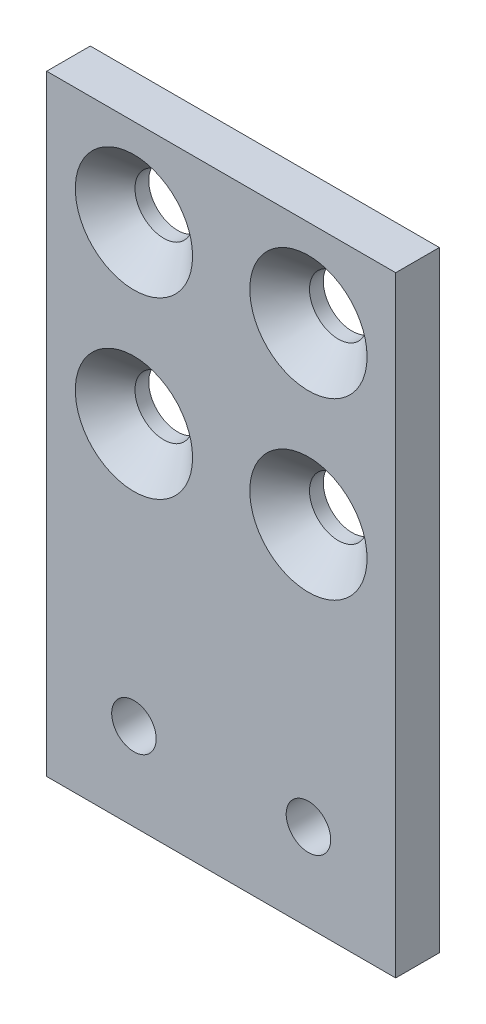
ISO-10303-21;
HEADER;
FILE_DESCRIPTION(('STEP AP214'),'2;1');
FILE_NAME('part.step','',(''),(''),'','','');
FILE_SCHEMA(('AUTOMOTIVE_DESIGN { 1 0 10303 214 1 1 1 1 }'));
ENDSEC;
DATA;
#1=APPLICATION_CONTEXT('core data for automotive mechanical design processes');
#2=APPLICATION_PROTOCOL_DEFINITION('international standard','automotive_design',2000,#1);
#3=PRODUCT_CONTEXT('',#1,'mechanical');
#4=PRODUCT('Part','Part','',(#3));
#5=PRODUCT_RELATED_PRODUCT_CATEGORY('part','',(#4));
#6=PRODUCT_DEFINITION_FORMATION('','',#4);
#7=PRODUCT_DEFINITION_CONTEXT('part definition',#1,'design');
#8=PRODUCT_DEFINITION('design','',#6,#7);
#9=PRODUCT_DEFINITION_SHAPE('','',#8);
#10=(LENGTH_UNIT() NAMED_UNIT(*) SI_UNIT(.MILLI.,.METRE.));
#11=(NAMED_UNIT(*) PLANE_ANGLE_UNIT() SI_UNIT($,.RADIAN.));
#12=(NAMED_UNIT(*) SI_UNIT($,.STERADIAN.) SOLID_ANGLE_UNIT());
#13=UNCERTAINTY_MEASURE_WITH_UNIT(LENGTH_MEASURE(1.E-05),#10,'distance_accuracy_value','');
#14=(GEOMETRIC_REPRESENTATION_CONTEXT(3) GLOBAL_UNCERTAINTY_ASSIGNED_CONTEXT((#13)) GLOBAL_UNIT_ASSIGNED_CONTEXT((#10,
#11,#12)) REPRESENTATION_CONTEXT('',''));
#15=CARTESIAN_POINT('',(0.,0.,0.));
#16=DIRECTION('',(0.,0.,1.));
#17=DIRECTION('',(1.,0.,0.));
#18=AXIS2_PLACEMENT_3D('',#15,#16,#17);
#19=CARTESIAN_POINT('',(-89.4885450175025,19.05,5.));
#20=DIRECTION('',(1.,0.,0.));
#21=DIRECTION('',(0.,1.,0.));
#22=AXIS2_PLACEMENT_3D('',#19,#20,#21);
#23=PLANE('',#22);
#24=DIRECTION('',(0.,-1.,0.));
#25=VECTOR('',#24,1.);
#26=CARTESIAN_POINT('',(-89.4885450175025,19.05,0.));
#27=LINE('',#26,#25);
#28=CARTESIAN_POINT('',(-89.4885450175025,19.05,0.));
#29=VERTEX_POINT('',#28);
#30=CARTESIAN_POINT('',(-89.4885450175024,-50.95,0.));
#31=VERTEX_POINT('',#30);
#32=EDGE_CURVE('E98',#29,#31,#27,.T.);
#33=ORIENTED_EDGE('',*,*,#32,.T.);
#34=DIRECTION('',(0.,0.,-1.));
#35=VECTOR('',#34,1.);
#36=CARTESIAN_POINT('',(-89.4885450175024,-50.95,5.));
#37=LINE('',#36,#35);
#38=CARTESIAN_POINT('',(-89.4885450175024,-50.95,5.));
#39=VERTEX_POINT('',#38);
#40=EDGE_CURVE('E11',#39,#31,#37,.T.);
#41=ORIENTED_EDGE('',*,*,#40,.F.);
#42=DIRECTION('',(0.,-1.,0.));
#43=VECTOR('',#42,1.);
#44=CARTESIAN_POINT('',(-89.4885450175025,19.05,5.));
#45=LINE('',#44,#43);
#46=CARTESIAN_POINT('',(-89.4885450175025,19.05,5.));
#47=VERTEX_POINT('',#46);
#48=EDGE_CURVE('E85',#47,#39,#45,.T.);
#49=ORIENTED_EDGE('',*,*,#48,.F.);
#50=DIRECTION('',(0.,0.,-1.));
#51=VECTOR('',#50,1.);
#52=CARTESIAN_POINT('',(-89.4885450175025,19.05,5.));
#53=LINE('',#52,#51);
#54=EDGE_CURVE('E94',#47,#29,#53,.T.);
#55=ORIENTED_EDGE('',*,*,#54,.T.);
#56=EDGE_LOOP('',(#33,#41,#49,#55));
#57=FACE_BOUND('',#56,.T.);
#58=ADVANCED_FACE('F32',(#57),#23,.F.);
#59=CARTESIAN_POINT('',(-89.4885450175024,-50.95,5.));
#60=DIRECTION('',(0.,1.,0.));
#61=DIRECTION('',(0.,0.,1.));
#62=AXIS2_PLACEMENT_3D('',#59,#60,#61);
#63=PLANE('',#62);
#64=DIRECTION('',(1.,0.,0.));
#65=VECTOR('',#64,1.);
#66=CARTESIAN_POINT('',(-89.4885450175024,-50.95,0.));
#67=LINE('',#66,#65);
#68=CARTESIAN_POINT('',(-49.4885450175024,-50.95,0.));
#69=VERTEX_POINT('',#68);
#70=EDGE_CURVE('E89',#31,#69,#67,.T.);
#71=ORIENTED_EDGE('',*,*,#70,.T.);
#72=DIRECTION('',(0.,0.,-1.));
#73=VECTOR('',#72,1.);
#74=CARTESIAN_POINT('',(-49.4885450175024,-50.95,5.));
#75=LINE('',#74,#73);
#76=CARTESIAN_POINT('',(-49.4885450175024,-50.95,5.));
#77=VERTEX_POINT('',#76);
#78=EDGE_CURVE('E41',#77,#69,#75,.T.);
#79=ORIENTED_EDGE('',*,*,#78,.F.);
#80=DIRECTION('',(1.,0.,0.));
#81=VECTOR('',#80,1.);
#82=CARTESIAN_POINT('',(-89.4885450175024,-50.95,5.));
#83=LINE('',#82,#81);
#84=EDGE_CURVE('E80',#39,#77,#83,.T.);
#85=ORIENTED_EDGE('',*,*,#84,.F.);
#86=ORIENTED_EDGE('',*,*,#40,.T.);
#87=EDGE_LOOP('',(#71,#79,#85,#86));
#88=FACE_BOUND('',#87,.T.);
#89=ADVANCED_FACE('F88',(#88),#63,.F.);
#90=CARTESIAN_POINT('',(-49.4885450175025,19.05,5.));
#91=DIRECTION('',(-1.,0.,0.));
#92=DIRECTION('',(0.,-1.,0.));
#93=AXIS2_PLACEMENT_3D('',#90,#91,#92);
#94=PLANE('',#93);
#95=DIRECTION('',(0.,1.,0.));
#96=VECTOR('',#95,1.);
#97=CARTESIAN_POINT('',(-49.4885450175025,19.05,0.));
#98=LINE('',#97,#96);
#99=CARTESIAN_POINT('',(-49.4885450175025,19.05,0.));
#100=VERTEX_POINT('',#99);
#101=EDGE_CURVE('E67',#69,#100,#98,.T.);
#102=ORIENTED_EDGE('',*,*,#101,.T.);
#103=DIRECTION('',(0.,0.,-1.));
#104=VECTOR('',#103,1.);
#105=CARTESIAN_POINT('',(-49.4885450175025,19.05,5.));
#106=LINE('',#105,#104);
#107=CARTESIAN_POINT('',(-49.4885450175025,19.05,5.));
#108=VERTEX_POINT('',#107);
#109=EDGE_CURVE('E90',#108,#100,#106,.T.);
#110=ORIENTED_EDGE('',*,*,#109,.F.);
#111=DIRECTION('',(0.,1.,0.));
#112=VECTOR('',#111,1.);
#113=CARTESIAN_POINT('',(-49.4885450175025,19.05,5.));
#114=LINE('',#113,#112);
#115=EDGE_CURVE('E83',#77,#108,#114,.T.);
#116=ORIENTED_EDGE('',*,*,#115,.F.);
#117=ORIENTED_EDGE('',*,*,#78,.T.);
#118=EDGE_LOOP('',(#102,#110,#116,#117));
#119=FACE_BOUND('',#118,.T.);
#120=ADVANCED_FACE('F92',(#119),#94,.F.);
#121=CARTESIAN_POINT('',(-89.4885450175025,19.05,5.));
#122=DIRECTION('',(0.,-1.,0.));
#123=DIRECTION('',(0.,0.,-1.));
#124=AXIS2_PLACEMENT_3D('',#121,#122,#123);
#125=PLANE('',#124);
#126=DIRECTION('',(-1.,0.,0.));
#127=VECTOR('',#126,1.);
#128=CARTESIAN_POINT('',(-89.4885450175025,19.05,0.));
#129=LINE('',#128,#127);
#130=EDGE_CURVE('E73',#100,#29,#129,.T.);
#131=ORIENTED_EDGE('',*,*,#130,.T.);
#132=ORIENTED_EDGE('',*,*,#54,.F.);
#133=DIRECTION('',(-1.,0.,0.));
#134=VECTOR('',#133,1.);
#135=CARTESIAN_POINT('',(-89.4885450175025,19.05,5.));
#136=LINE('',#135,#134);
#137=EDGE_CURVE('E50',#108,#47,#136,.T.);
#138=ORIENTED_EDGE('',*,*,#137,.F.);
#139=ORIENTED_EDGE('',*,*,#109,.T.);
#140=EDGE_LOOP('',(#131,#132,#138,#139));
#141=FACE_BOUND('',#140,.T.);
#142=ADVANCED_FACE('F172',(#141),#125,.F.);
#143=CARTESIAN_POINT('',(-89.4885450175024,-50.95,5.));
#144=DIRECTION('',(0.,0.,1.));
#145=DIRECTION('',(1.,0.,0.));
#146=AXIS2_PLACEMENT_3D('',#143,#144,#145);
#147=PLANE('',#146);
#148=CARTESIAN_POINT('',(-79.4885450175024,-40.95,5.));
#149=DIRECTION('',(0.,0.,1.));
#150=DIRECTION('',(1.,0.,0.));
#151=AXIS2_PLACEMENT_3D('',#148,#149,#150);
#152=CIRCLE('',#151,2.55);
#153=CARTESIAN_POINT('',(-76.9385450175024,-40.95,5.));
#154=VERTEX_POINT('',#153);
#155=EDGE_CURVE('E120',#154,#154,#152,.T.);
#156=ORIENTED_EDGE('',*,*,#155,.F.);
#157=EDGE_LOOP('',(#156));
#158=FACE_BOUND('',#157,.T.);
#159=CARTESIAN_POINT('',(-59.4885450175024,-40.95,5.));
#160=DIRECTION('',(0.,0.,1.));
#161=DIRECTION('',(1.,0.,0.));
#162=AXIS2_PLACEMENT_3D('',#159,#160,#161);
#163=CIRCLE('',#162,2.55);
#164=CARTESIAN_POINT('',(-56.9385450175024,-40.95,5.));
#165=VERTEX_POINT('',#164);
#166=EDGE_CURVE('E109',#165,#165,#163,.T.);
#167=ORIENTED_EDGE('',*,*,#166,.F.);
#168=EDGE_LOOP('',(#167));
#169=FACE_BOUND('',#168,.T.);
#170=CARTESIAN_POINT('',(-59.4885450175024,9.05,5.));
#171=DIRECTION('',(0.,0.,1.));
#172=DIRECTION('',(1.,0.,0.));
#173=AXIS2_PLACEMENT_3D('',#170,#171,#172);
#174=CIRCLE('',#173,6.72);
#175=CARTESIAN_POINT('',(-52.7685450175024,9.05,5.));
#176=VERTEX_POINT('',#175);
#177=EDGE_CURVE('E108',#176,#176,#174,.T.);
#178=ORIENTED_EDGE('',*,*,#177,.F.);
#179=EDGE_LOOP('',(#178));
#180=FACE_BOUND('',#179,.T.);
#181=CARTESIAN_POINT('',(-79.4885450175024,9.05,5.));
#182=DIRECTION('',(0.,0.,1.));
#183=DIRECTION('',(1.,0.,0.));
#184=AXIS2_PLACEMENT_3D('',#181,#182,#183);
#185=CIRCLE('',#184,6.72);
#186=CARTESIAN_POINT('',(-72.7685450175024,9.05,5.));
#187=VERTEX_POINT('',#186);
#188=EDGE_CURVE('E128',#187,#187,#185,.T.);
#189=ORIENTED_EDGE('',*,*,#188,.F.);
#190=EDGE_LOOP('',(#189));
#191=FACE_BOUND('',#190,.T.);
#192=CARTESIAN_POINT('',(-59.4885450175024,-10.95,5.));
#193=DIRECTION('',(0.,0.,1.));
#194=DIRECTION('',(1.,0.,0.));
#195=AXIS2_PLACEMENT_3D('',#192,#193,#194);
#196=CIRCLE('',#195,6.72);
#197=CARTESIAN_POINT('',(-52.7685450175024,-10.95,5.));
#198=VERTEX_POINT('',#197);
#199=EDGE_CURVE('E137',#198,#198,#196,.T.);
#200=ORIENTED_EDGE('',*,*,#199,.F.);
#201=EDGE_LOOP('',(#200));
#202=FACE_BOUND('',#201,.T.);
#203=CARTESIAN_POINT('',(-79.4885450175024,-10.95,5.));
#204=DIRECTION('',(0.,0.,1.));
#205=DIRECTION('',(1.,0.,0.));
#206=AXIS2_PLACEMENT_3D('',#203,#204,#205);
#207=CIRCLE('',#206,6.72);
#208=CARTESIAN_POINT('',(-72.7685450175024,-10.95,5.));
#209=VERTEX_POINT('',#208);
#210=EDGE_CURVE('E146',#209,#209,#207,.T.);
#211=ORIENTED_EDGE('',*,*,#210,.F.);
#212=EDGE_LOOP('',(#211));
#213=FACE_BOUND('',#212,.T.);
#214=ORIENTED_EDGE('',*,*,#48,.T.);
#215=ORIENTED_EDGE('',*,*,#84,.T.);
#216=ORIENTED_EDGE('',*,*,#115,.T.);
#217=ORIENTED_EDGE('',*,*,#137,.T.);
#218=EDGE_LOOP('',(#214,#215,#216,#217));
#219=FACE_BOUND('',#218,.T.);
#220=ADVANCED_FACE('F81',(#158,#169,#180,#191,#202,#213,#219),#147,.T.);
#221=CARTESIAN_POINT('',(-89.4885450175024,-50.95,0.));
#222=DIRECTION('',(0.,0.,1.));
#223=DIRECTION('',(1.,0.,0.));
#224=AXIS2_PLACEMENT_3D('',#221,#222,#223);
#225=PLANE('',#224);
#226=CARTESIAN_POINT('',(-79.4885450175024,-40.95,0.));
#227=DIRECTION('',(0.,0.,1.));
#228=DIRECTION('',(1.,0.,0.));
#229=AXIS2_PLACEMENT_3D('',#226,#227,#228);
#230=CIRCLE('',#229,2.55);
#231=CARTESIAN_POINT('',(-76.9385450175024,-40.95,0.));
#232=VERTEX_POINT('',#231);
#233=EDGE_CURVE('E35',#232,#232,#230,.T.);
#234=ORIENTED_EDGE('',*,*,#233,.T.);
#235=EDGE_LOOP('',(#234));
#236=FACE_BOUND('',#235,.T.);
#237=CARTESIAN_POINT('',(-59.4885450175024,-40.95,0.));
#238=DIRECTION('',(0.,0.,1.));
#239=DIRECTION('',(1.,0.,0.));
#240=AXIS2_PLACEMENT_3D('',#237,#238,#239);
#241=CIRCLE('',#240,2.55);
#242=CARTESIAN_POINT('',(-56.9385450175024,-40.95,0.));
#243=VERTEX_POINT('',#242);
#244=EDGE_CURVE('E106',#243,#243,#241,.T.);
#245=ORIENTED_EDGE('',*,*,#244,.T.);
#246=EDGE_LOOP('',(#245));
#247=FACE_BOUND('',#246,.T.);
#248=CARTESIAN_POINT('',(-59.4885450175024,9.05,0.));
#249=DIRECTION('',(0.,0.,1.));
#250=DIRECTION('',(1.,0.,0.));
#251=AXIS2_PLACEMENT_3D('',#248,#249,#250);
#252=CIRCLE('',#251,3.3);
#253=CARTESIAN_POINT('',(-56.1885450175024,9.05,0.));
#254=VERTEX_POINT('',#253);
#255=EDGE_CURVE('E125',#254,#254,#252,.T.);
#256=ORIENTED_EDGE('',*,*,#255,.T.);
#257=EDGE_LOOP('',(#256));
#258=FACE_BOUND('',#257,.T.);
#259=CARTESIAN_POINT('',(-79.4885450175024,9.05,0.));
#260=DIRECTION('',(0.,0.,1.));
#261=DIRECTION('',(1.,0.,0.));
#262=AXIS2_PLACEMENT_3D('',#259,#260,#261);
#263=CIRCLE('',#262,3.3);
#264=CARTESIAN_POINT('',(-76.1885450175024,9.05,0.));
#265=VERTEX_POINT('',#264);
#266=EDGE_CURVE('E134',#265,#265,#263,.T.);
#267=ORIENTED_EDGE('',*,*,#266,.T.);
#268=EDGE_LOOP('',(#267));
#269=FACE_BOUND('',#268,.T.);
#270=CARTESIAN_POINT('',(-59.4885450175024,-10.95,0.));
#271=DIRECTION('',(0.,0.,1.));
#272=DIRECTION('',(1.,0.,0.));
#273=AXIS2_PLACEMENT_3D('',#270,#271,#272);
#274=CIRCLE('',#273,3.3);
#275=CARTESIAN_POINT('',(-56.1885450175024,-10.95,0.));
#276=VERTEX_POINT('',#275);
#277=EDGE_CURVE('E143',#276,#276,#274,.T.);
#278=ORIENTED_EDGE('',*,*,#277,.T.);
#279=EDGE_LOOP('',(#278));
#280=FACE_BOUND('',#279,.T.);
#281=CARTESIAN_POINT('',(-79.4885450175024,-10.95,0.));
#282=DIRECTION('',(0.,0.,1.));
#283=DIRECTION('',(1.,0.,0.));
#284=AXIS2_PLACEMENT_3D('',#281,#282,#283);
#285=CIRCLE('',#284,3.3);
#286=CARTESIAN_POINT('',(-76.1885450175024,-10.95,0.));
#287=VERTEX_POINT('',#286);
#288=EDGE_CURVE('E101',#287,#287,#285,.T.);
#289=ORIENTED_EDGE('',*,*,#288,.T.);
#290=EDGE_LOOP('',(#289));
#291=FACE_BOUND('',#290,.T.);
#292=ORIENTED_EDGE('',*,*,#32,.F.);
#293=ORIENTED_EDGE('',*,*,#130,.F.);
#294=ORIENTED_EDGE('',*,*,#101,.F.);
#295=ORIENTED_EDGE('',*,*,#70,.F.);
#296=EDGE_LOOP('',(#292,#293,#294,#295));
#297=FACE_BOUND('',#296,.T.);
#298=ADVANCED_FACE('F155',(#236,#247,#258,#269,#280,#291,#297),#225,.F.);
#299=CARTESIAN_POINT('',(-79.4885450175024,-10.95,5.));
#300=DIRECTION('',(0.,0.,1.));
#301=DIRECTION('',(1.,0.,0.));
#302=AXIS2_PLACEMENT_3D('',#299,#300,#301);
#303=CYLINDRICAL_SURFACE('',#302,3.3);
#304=ORIENTED_EDGE('',*,*,#288,.F.);
#305=EDGE_LOOP('',(#304));
#306=FACE_BOUND('',#305,.T.);
#307=CARTESIAN_POINT('',(-79.4885450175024,-10.95,1.58));
#308=DIRECTION('',(0.,0.,1.));
#309=DIRECTION('',(1.,0.,0.));
#310=AXIS2_PLACEMENT_3D('',#307,#308,#309);
#311=CIRCLE('',#310,3.3);
#312=CARTESIAN_POINT('',(-76.1885450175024,-10.95,1.58));
#313=VERTEX_POINT('',#312);
#314=EDGE_CURVE('E149',#313,#313,#311,.T.);
#315=ORIENTED_EDGE('',*,*,#314,.T.);
#316=EDGE_LOOP('',(#315));
#317=FACE_BOUND('',#316,.T.);
#318=ADVANCED_FACE('F158',(#306,#317),#303,.F.);
#319=CARTESIAN_POINT('',(-79.4885450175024,-10.95,5.));
#320=DIRECTION('',(0.,0.,1.));
#321=DIRECTION('',(1.,0.,0.));
#322=AXIS2_PLACEMENT_3D('',#319,#320,#321);
#323=CONICAL_SURFACE('',#322,6.72,0.785398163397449);
#324=ORIENTED_EDGE('',*,*,#314,.F.);
#325=EDGE_LOOP('',(#324));
#326=FACE_BOUND('',#325,.T.);
#327=ORIENTED_EDGE('',*,*,#210,.T.);
#328=EDGE_LOOP('',(#327));
#329=FACE_BOUND('',#328,.T.);
#330=ADVANCED_FACE('F161',(#326,#329),#323,.F.);
#331=CARTESIAN_POINT('',(-59.4885450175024,-10.95,5.));
#332=DIRECTION('',(0.,0.,1.));
#333=DIRECTION('',(1.,0.,0.));
#334=AXIS2_PLACEMENT_3D('',#331,#332,#333);
#335=CYLINDRICAL_SURFACE('',#334,3.3);
#336=ORIENTED_EDGE('',*,*,#277,.F.);
#337=EDGE_LOOP('',(#336));
#338=FACE_BOUND('',#337,.T.);
#339=CARTESIAN_POINT('',(-59.4885450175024,-10.95,1.58));
#340=DIRECTION('',(0.,0.,1.));
#341=DIRECTION('',(1.,0.,0.));
#342=AXIS2_PLACEMENT_3D('',#339,#340,#341);
#343=CIRCLE('',#342,3.3);
#344=CARTESIAN_POINT('',(-56.1885450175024,-10.95,1.58));
#345=VERTEX_POINT('',#344);
#346=EDGE_CURVE('E140',#345,#345,#343,.T.);
#347=ORIENTED_EDGE('',*,*,#346,.T.);
#348=EDGE_LOOP('',(#347));
#349=FACE_BOUND('',#348,.T.);
#350=ADVANCED_FACE('F167',(#338,#349),#335,.F.);
#351=CARTESIAN_POINT('',(-59.4885450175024,-10.95,5.));
#352=DIRECTION('',(0.,0.,1.));
#353=DIRECTION('',(1.,0.,0.));
#354=AXIS2_PLACEMENT_3D('',#351,#352,#353);
#355=CONICAL_SURFACE('',#354,6.72,0.785398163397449);
#356=ORIENTED_EDGE('',*,*,#346,.F.);
#357=EDGE_LOOP('',(#356));
#358=FACE_BOUND('',#357,.T.);
#359=ORIENTED_EDGE('',*,*,#199,.T.);
#360=EDGE_LOOP('',(#359));
#361=FACE_BOUND('',#360,.T.);
#362=ADVANCED_FACE('F223',(#358,#361),#355,.F.);
#363=CARTESIAN_POINT('',(-79.4885450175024,9.05,5.));
#364=DIRECTION('',(0.,0.,1.));
#365=DIRECTION('',(1.,0.,0.));
#366=AXIS2_PLACEMENT_3D('',#363,#364,#365);
#367=CYLINDRICAL_SURFACE('',#366,3.3);
#368=ORIENTED_EDGE('',*,*,#266,.F.);
#369=EDGE_LOOP('',(#368));
#370=FACE_BOUND('',#369,.T.);
#371=CARTESIAN_POINT('',(-79.4885450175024,9.05,1.58));
#372=DIRECTION('',(0.,0.,1.));
#373=DIRECTION('',(1.,0.,0.));
#374=AXIS2_PLACEMENT_3D('',#371,#372,#373);
#375=CIRCLE('',#374,3.3);
#376=CARTESIAN_POINT('',(-76.1885450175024,9.05,1.58));
#377=VERTEX_POINT('',#376);
#378=EDGE_CURVE('E131',#377,#377,#375,.T.);
#379=ORIENTED_EDGE('',*,*,#378,.T.);
#380=EDGE_LOOP('',(#379));
#381=FACE_BOUND('',#380,.T.);
#382=ADVANCED_FACE('F233',(#370,#381),#367,.F.);
#383=CARTESIAN_POINT('',(-79.4885450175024,9.05,5.));
#384=DIRECTION('',(0.,0.,1.));
#385=DIRECTION('',(1.,0.,0.));
#386=AXIS2_PLACEMENT_3D('',#383,#384,#385);
#387=CONICAL_SURFACE('',#386,6.72,0.785398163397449);
#388=ORIENTED_EDGE('',*,*,#378,.F.);
#389=EDGE_LOOP('',(#388));
#390=FACE_BOUND('',#389,.T.);
#391=ORIENTED_EDGE('',*,*,#188,.T.);
#392=EDGE_LOOP('',(#391));
#393=FACE_BOUND('',#392,.T.);
#394=ADVANCED_FACE('F243',(#390,#393),#387,.F.);
#395=CARTESIAN_POINT('',(-59.4885450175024,9.05,5.));
#396=DIRECTION('',(0.,0.,1.));
#397=DIRECTION('',(1.,0.,0.));
#398=AXIS2_PLACEMENT_3D('',#395,#396,#397);
#399=CYLINDRICAL_SURFACE('',#398,3.3);
#400=ORIENTED_EDGE('',*,*,#255,.F.);
#401=EDGE_LOOP('',(#400));
#402=FACE_BOUND('',#401,.T.);
#403=CARTESIAN_POINT('',(-59.4885450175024,9.05,1.58));
#404=DIRECTION('',(0.,0.,1.));
#405=DIRECTION('',(1.,0.,0.));
#406=AXIS2_PLACEMENT_3D('',#403,#404,#405);
#407=CIRCLE('',#406,3.3);
#408=CARTESIAN_POINT('',(-56.1885450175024,9.05,1.58));
#409=VERTEX_POINT('',#408);
#410=EDGE_CURVE('E113',#409,#409,#407,.T.);
#411=ORIENTED_EDGE('',*,*,#410,.T.);
#412=EDGE_LOOP('',(#411));
#413=FACE_BOUND('',#412,.T.);
#414=ADVANCED_FACE('F253',(#402,#413),#399,.F.);
#415=CARTESIAN_POINT('',(-59.4885450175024,9.05,5.));
#416=DIRECTION('',(0.,0.,1.));
#417=DIRECTION('',(1.,0.,0.));
#418=AXIS2_PLACEMENT_3D('',#415,#416,#417);
#419=CONICAL_SURFACE('',#418,6.72,0.785398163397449);
#420=ORIENTED_EDGE('',*,*,#410,.F.);
#421=EDGE_LOOP('',(#420));
#422=FACE_BOUND('',#421,.T.);
#423=ORIENTED_EDGE('',*,*,#177,.T.);
#424=EDGE_LOOP('',(#423));
#425=FACE_BOUND('',#424,.T.);
#426=ADVANCED_FACE('F263',(#422,#425),#419,.F.);
#427=CARTESIAN_POINT('',(-59.4885450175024,-40.95,5.));
#428=DIRECTION('',(0.,0.,1.));
#429=DIRECTION('',(1.,0.,0.));
#430=AXIS2_PLACEMENT_3D('',#427,#428,#429);
#431=CYLINDRICAL_SURFACE('',#430,2.55);
#432=ORIENTED_EDGE('',*,*,#166,.T.);
#433=EDGE_LOOP('',(#432));
#434=FACE_BOUND('',#433,.T.);
#435=ORIENTED_EDGE('',*,*,#244,.F.);
#436=EDGE_LOOP('',(#435));
#437=FACE_BOUND('',#436,.T.);
#438=ADVANCED_FACE('F272',(#434,#437),#431,.F.);
#439=CARTESIAN_POINT('',(-79.4885450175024,-40.95,5.));
#440=DIRECTION('',(0.,0.,1.));
#441=DIRECTION('',(1.,0.,0.));
#442=AXIS2_PLACEMENT_3D('',#439,#440,#441);
#443=CYLINDRICAL_SURFACE('',#442,2.55);
#444=ORIENTED_EDGE('',*,*,#155,.T.);
#445=EDGE_LOOP('',(#444));
#446=FACE_BOUND('',#445,.T.);
#447=ORIENTED_EDGE('',*,*,#233,.F.);
#448=EDGE_LOOP('',(#447));
#449=FACE_BOUND('',#448,.T.);
#450=ADVANCED_FACE('F291',(#446,#449),#443,.F.);
#451=CLOSED_SHELL('',(#58,#89,#120,#142,#220,#298,#318,#330,#350,#362,#382,#394,#414,#426,#438,#450));
#452=MANIFOLD_SOLID_BREP('B2',#451);
#453=ADVANCED_BREP_SHAPE_REPRESENTATION('',(#18,#452),#14);
#454=SHAPE_DEFINITION_REPRESENTATION(#9,#453);
ENDSEC;
END-ISO-10303-21;
